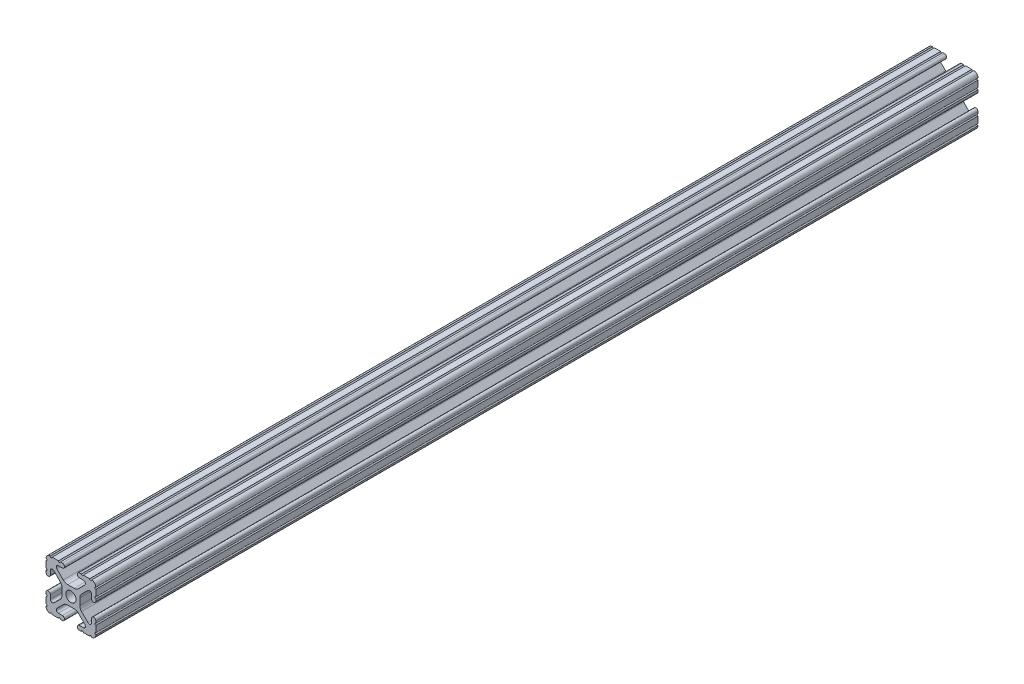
from build123d import *

# Parameters (mm, degrees)
SKETCH1_R      = 2.6035
EXTRUDE1_DEPTH = 450


with BuildPart() as part:
    # Sketch1 → Extrude1 (new body)
    with BuildSketch(Plane.XY):
        with BuildLine():
            Line((10.5918, 12.7), (10.5664, 12.7))
            ThreePointArc((10.5664, 12.7), (10.0584, 12.192), (9.5504, 12.7))
            Line((9.5504, 12.7), (6.3246, 12.7))
            ThreePointArc((6.3246, 12.7), (5.8166, 12.192), (5.3086, 12.7))
            Line((5.3086, 12.7), (4.3561, 12.7))
            ThreePointArc((4.3561, 12.7), (3.2512, 11.5951), (4.3561, 10.4902))
            Line((4.3561, 10.4902), (6.370083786, 10.4902))
            ThreePointArc((6.370083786, 10.4902), (7.348856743, 9.836204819), (7.119204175, 8.681663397))
            Line((7.119204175, 8.681663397), (3.88464389, 5.447103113))
            ThreePointArc((3.88464389, 5.447103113), (2.854599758, 4.758849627), (1.63957986, 4.517167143))
            Line((1.63957986, 4.517167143), (-1.63957986, 4.517167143))
            ThreePointArc((-1.63957986, 4.517167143), (-2.854599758, 4.758849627), (-3.88464389, 5.447103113))
            Line((-3.88464389, 5.447103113), (-7.119204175, 8.681663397))
            ThreePointArc((-7.119204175, 8.681663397), (-7.348856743, 9.836204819), (-6.370083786, 10.4902))
            Line((-6.370083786, 10.4902), (-4.3561, 10.4902))
            ThreePointArc((-4.3561, 10.4902), (-3.2512, 11.5951), (-4.3561, 12.7))
            Line((-4.3561, 12.7), (-5.3086, 12.7))
            ThreePointArc((-5.3086, 12.7), (-5.8166, 12.192), (-6.3246, 12.7))
            Line((-6.3246, 12.7), (-9.5504, 12.7))
            ThreePointArc((-9.5504, 12.7), (-10.0584, 12.192), (-10.5664, 12.7))
            Line((-10.5664, 12.7), (-10.5918, 12.7))
            ThreePointArc((-10.5918, 12.7), (-12.082522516, 12.082522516), (-12.7, 10.5918))
            Line((-12.7, 10.5918), (-12.7, 10.5664))
            ThreePointArc((-12.7, 10.5664), (-12.192, 10.0584), (-12.7, 9.5504))
            Line((-12.7, 9.5504), (-12.7, 6.3246))
            ThreePointArc((-12.7, 6.3246), (-12.192, 5.8166), (-12.7, 5.3086))
            Line((-12.7, 5.3086), (-12.7, 4.3561))
            ThreePointArc((-12.7, 4.3561), (-11.5951, 3.2512), (-10.4902, 4.3561))
            Line((-10.4902, 4.3561), (-10.4902, 6.370083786))
            ThreePointArc((-10.4902, 6.370083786), (-9.836204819, 7.348856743), (-8.681663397, 7.119204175))
            Line((-8.681663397, 7.119204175), (-5.447103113, 3.88464389))
            ThreePointArc((-5.447103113, 3.88464389), (-4.758849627, 2.854599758), (-4.517167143, 1.63957986))
            Line((-4.517167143, 1.63957986), (-4.517167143, -1.63957986))
            ThreePointArc((-4.517167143, -1.63957986), (-4.758849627, -2.854599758), (-5.447103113, -3.88464389))
            Line((-5.447103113, -3.88464389), (-8.681663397, -7.119204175))
            ThreePointArc((-8.681663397, -7.119204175), (-9.836204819, -7.348856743), (-10.4902, -6.370083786))
            Line((-10.4902, -6.370083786), (-10.4902, -4.3561))
            ThreePointArc((-10.4902, -4.3561), (-11.5951, -3.2512), (-12.7, -4.3561))
            Line((-12.7, -4.3561), (-12.7, -5.3086))
            ThreePointArc((-12.7, -5.3086), (-12.192, -5.8166), (-12.7, -6.3246))
            Line((-12.7, -6.3246), (-12.7, -9.5504))
            ThreePointArc((-12.7, -9.5504), (-12.192, -10.0584), (-12.7, -10.5664))
            Line((-12.7, -10.5664), (-12.7, -10.5918))
            ThreePointArc((-12.7, -10.5918), (-12.082522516, -12.082522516), (-10.5918, -12.7))
            Line((-10.5918, -12.7), (-10.5664, -12.7))
            ThreePointArc((-10.5664, -12.7), (-10.0584, -12.192), (-9.5504, -12.7))
            Line((-9.5504, -12.7), (-6.3246, -12.7))
            ThreePointArc((-6.3246, -12.7), (-5.8166, -12.192), (-5.3086, -12.7))
            Line((-5.3086, -12.7), (-4.3561, -12.7))
            ThreePointArc((-4.3561, -12.7), (-3.2512, -11.5951), (-4.3561, -10.4902))
            Line((-4.3561, -10.4902), (-6.370083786, -10.4902))
            ThreePointArc((-6.370083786, -10.4902), (-7.348856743, -9.836204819), (-7.119204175, -8.681663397))
            Line((-7.119204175, -8.681663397), (-3.88464389, -5.447103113))
            ThreePointArc((-3.88464389, -5.447103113), (-2.854599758, -4.758849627), (-1.63957986, -4.517167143))
            Line((-1.63957986, -4.517167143), (1.63957986, -4.517167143))
            ThreePointArc((1.63957986, -4.517167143), (2.854599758, -4.758849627), (3.88464389, -5.447103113))
            Line((3.88464389, -5.447103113), (7.119204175, -8.681663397))
            ThreePointArc((7.119204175, -8.681663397), (7.348856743, -9.836204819), (6.370083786, -10.4902))
            Line((6.370083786, -10.4902), (4.3561, -10.4902))
            ThreePointArc((4.3561, -10.4902), (3.2512, -11.5951), (4.3561, -12.7))
            Line((4.3561, -12.7), (5.3086, -12.7))
            ThreePointArc((5.3086, -12.7), (5.8166, -12.192), (6.3246, -12.7))
            Line((6.3246, -12.7), (9.5504, -12.7))
            ThreePointArc((9.5504, -12.7), (10.0584, -12.192), (10.5664, -12.7))
            Line((10.5664, -12.7), (10.5918, -12.7))
            ThreePointArc((10.5918, -12.7), (12.082522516, -12.082522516), (12.7, -10.5918))
            Line((12.7, -10.5918), (12.7, -10.5664))
            ThreePointArc((12.7, -10.5664), (12.192, -10.0584), (12.7, -9.5504))
            Line((12.7, -9.5504), (12.7, -6.3246))
            ThreePointArc((12.7, -6.3246), (12.192, -5.8166), (12.7, -5.3086))
            Line((12.7, -5.3086), (12.7, -4.3561))
            ThreePointArc((12.7, -4.3561), (11.5951, -3.2512), (10.4902, -4.3561))
            Line((10.4902, -4.3561), (10.4902, -6.370083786))
            ThreePointArc((10.4902, -6.370083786), (9.836204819, -7.348856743), (8.681663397, -7.119204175))
            Line((8.681663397, -7.119204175), (5.447103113, -3.88464389))
            ThreePointArc((5.447103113, -3.88464389), (4.758849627, -2.854599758), (4.517167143, -1.63957986))
            Line((4.517167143, -1.63957986), (4.517167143, 1.63957986))
            ThreePointArc((4.517167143, 1.63957986), (4.758849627, 2.854599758), (5.447103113, 3.88464389))
            Line((5.447103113, 3.88464389), (8.681663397, 7.119204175))
            ThreePointArc((8.681663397, 7.119204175), (9.836204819, 7.348856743), (10.4902, 6.370083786))
            Line((10.4902, 6.370083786), (10.4902, 4.3561))
            ThreePointArc((10.4902, 4.3561), (11.5951, 3.2512), (12.7, 4.3561))
            Line((12.7, 4.3561), (12.7, 5.3086))
            ThreePointArc((12.7, 5.3086), (12.192, 5.8166), (12.7, 6.3246))
            Line((12.7, 6.3246), (12.7, 9.5504))
            ThreePointArc((12.7, 9.5504), (12.192, 10.0584), (12.7, 10.5664))
            Line((12.7, 10.5664), (12.7, 10.5918))
            ThreePointArc((12.7, 10.5918), (12.082522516, 12.082522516), (10.5918, 12.7))
        make_face()
        Circle(SKETCH1_R, mode=Mode.SUBTRACT)
    extrude(amount=-EXTRUDE1_DEPTH)


solid = part.part
